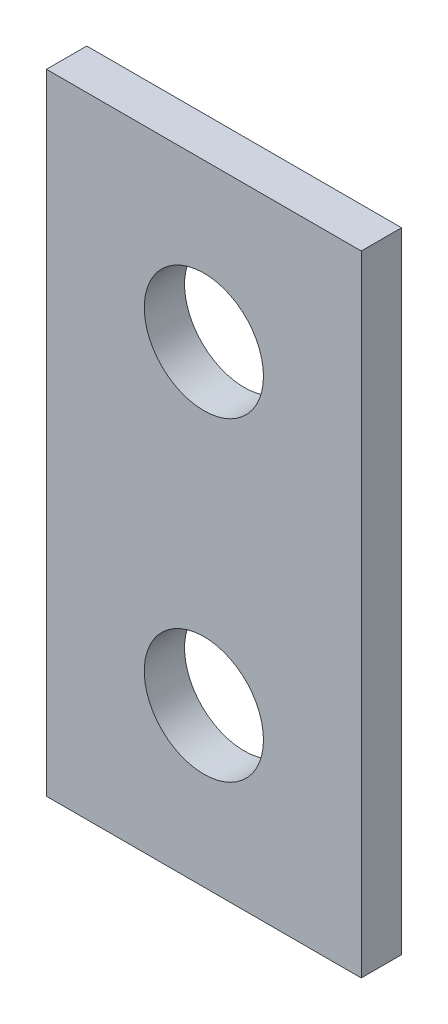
ISO-10303-21;
HEADER;
FILE_DESCRIPTION(('STEP AP214'),'2;1');
FILE_NAME('part.step','',(''),(''),'','','');
FILE_SCHEMA(('AUTOMOTIVE_DESIGN { 1 0 10303 214 1 1 1 1 }'));
ENDSEC;
DATA;
#1=APPLICATION_CONTEXT('core data for automotive mechanical design processes');
#2=APPLICATION_PROTOCOL_DEFINITION('international standard','automotive_design',2000,#1);
#3=PRODUCT_CONTEXT('',#1,'mechanical');
#4=PRODUCT('Part','Part','',(#3));
#5=PRODUCT_RELATED_PRODUCT_CATEGORY('part','',(#4));
#6=PRODUCT_DEFINITION_FORMATION('','',#4);
#7=PRODUCT_DEFINITION_CONTEXT('part definition',#1,'design');
#8=PRODUCT_DEFINITION('design','',#6,#7);
#9=PRODUCT_DEFINITION_SHAPE('','',#8);
#10=(LENGTH_UNIT() NAMED_UNIT(*) SI_UNIT(.MILLI.,.METRE.));
#11=(NAMED_UNIT(*) PLANE_ANGLE_UNIT() SI_UNIT($,.RADIAN.));
#12=(NAMED_UNIT(*) SI_UNIT($,.STERADIAN.) SOLID_ANGLE_UNIT());
#13=UNCERTAINTY_MEASURE_WITH_UNIT(LENGTH_MEASURE(1.E-05),#10,'distance_accuracy_value','');
#14=(GEOMETRIC_REPRESENTATION_CONTEXT(3) GLOBAL_UNCERTAINTY_ASSIGNED_CONTEXT((#13)) GLOBAL_UNIT_ASSIGNED_CONTEXT((#10,
#11,#12)) REPRESENTATION_CONTEXT('',''));
#15=CARTESIAN_POINT('',(0.,0.,0.));
#16=DIRECTION('',(0.,0.,1.));
#17=DIRECTION('',(1.,0.,0.));
#18=AXIS2_PLACEMENT_3D('',#15,#16,#17);
#19=CARTESIAN_POINT('',(4.7625,-9.525,-1.2192));
#20=DIRECTION('',(1.,0.,0.));
#21=DIRECTION('',(0.,0.,-1.));
#22=AXIS2_PLACEMENT_3D('',#19,#20,#21);
#23=PLANE('',#22);
#24=DIRECTION('',(0.,1.,0.));
#25=VECTOR('',#24,1.);
#26=CARTESIAN_POINT('',(4.7625,-9.525,0.));
#27=LINE('',#26,#25);
#28=CARTESIAN_POINT('',(4.7625,-9.525,0.));
#29=VERTEX_POINT('',#28);
#30=CARTESIAN_POINT('',(4.7625,9.525,0.));
#31=VERTEX_POINT('',#30);
#32=EDGE_CURVE('E100',#29,#31,#27,.T.);
#33=ORIENTED_EDGE('',*,*,#32,.F.);
#34=DIRECTION('',(0.,0.,1.));
#35=VECTOR('',#34,1.);
#36=CARTESIAN_POINT('',(4.7625,-9.525,-1.2192));
#37=LINE('',#36,#35);
#38=CARTESIAN_POINT('',(4.7625,-9.525,-1.2192));
#39=VERTEX_POINT('',#38);
#40=EDGE_CURVE('E11',#39,#29,#37,.T.);
#41=ORIENTED_EDGE('',*,*,#40,.F.);
#42=DIRECTION('',(0.,1.,0.));
#43=VECTOR('',#42,1.);
#44=CARTESIAN_POINT('',(4.7625,-9.525,-1.2192));
#45=LINE('',#44,#43);
#46=CARTESIAN_POINT('',(4.7625,9.525,-1.2192));
#47=VERTEX_POINT('',#46);
#48=EDGE_CURVE('E93',#39,#47,#45,.T.);
#49=ORIENTED_EDGE('',*,*,#48,.T.);
#50=DIRECTION('',(0.,0.,1.));
#51=VECTOR('',#50,1.);
#52=CARTESIAN_POINT('',(4.7625,9.525,-1.2192));
#53=LINE('',#52,#51);
#54=EDGE_CURVE('E38',#47,#31,#53,.T.);
#55=ORIENTED_EDGE('',*,*,#54,.T.);
#56=EDGE_LOOP('',(#33,#41,#49,#55));
#57=FACE_BOUND('',#56,.T.);
#58=ADVANCED_FACE('F35',(#57),#23,.T.);
#59=CARTESIAN_POINT('',(-4.7625,-9.525,-1.2192));
#60=DIRECTION('',(0.,-1.,0.));
#61=DIRECTION('',(0.,0.,-1.));
#62=AXIS2_PLACEMENT_3D('',#59,#60,#61);
#63=PLANE('',#62);
#64=DIRECTION('',(1.,0.,0.));
#65=VECTOR('',#64,1.);
#66=CARTESIAN_POINT('',(-4.7625,-9.525,0.));
#67=LINE('',#66,#65);
#68=CARTESIAN_POINT('',(-4.7625,-9.525,0.));
#69=VERTEX_POINT('',#68);
#70=EDGE_CURVE('E95',#69,#29,#67,.T.);
#71=ORIENTED_EDGE('',*,*,#70,.F.);
#72=DIRECTION('',(0.,0.,1.));
#73=VECTOR('',#72,1.);
#74=CARTESIAN_POINT('',(-4.7625,-9.525,-1.2192));
#75=LINE('',#74,#73);
#76=CARTESIAN_POINT('',(-4.7625,-9.525,-1.2192));
#77=VERTEX_POINT('',#76);
#78=EDGE_CURVE('E44',#77,#69,#75,.T.);
#79=ORIENTED_EDGE('',*,*,#78,.F.);
#80=DIRECTION('',(1.,0.,0.));
#81=VECTOR('',#80,1.);
#82=CARTESIAN_POINT('',(-4.7625,-9.525,-1.2192));
#83=LINE('',#82,#81);
#84=EDGE_CURVE('E90',#77,#39,#83,.T.);
#85=ORIENTED_EDGE('',*,*,#84,.T.);
#86=ORIENTED_EDGE('',*,*,#40,.T.);
#87=EDGE_LOOP('',(#71,#79,#85,#86));
#88=FACE_BOUND('',#87,.T.);
#89=ADVANCED_FACE('F111',(#88),#63,.T.);
#90=CARTESIAN_POINT('',(-4.7625,-9.525,-1.2192));
#91=DIRECTION('',(-1.,0.,0.));
#92=DIRECTION('',(0.,0.,1.));
#93=AXIS2_PLACEMENT_3D('',#90,#91,#92);
#94=PLANE('',#93);
#95=DIRECTION('',(0.,-1.,0.));
#96=VECTOR('',#95,1.);
#97=CARTESIAN_POINT('',(-4.7625,-9.525,0.));
#98=LINE('',#97,#96);
#99=CARTESIAN_POINT('',(-4.7625,9.525,0.));
#100=VERTEX_POINT('',#99);
#101=EDGE_CURVE('E85',#100,#69,#98,.T.);
#102=ORIENTED_EDGE('',*,*,#101,.F.);
#103=DIRECTION('',(0.,0.,1.));
#104=VECTOR('',#103,1.);
#105=CARTESIAN_POINT('',(-4.7625,9.525,-1.2192));
#106=LINE('',#105,#104);
#107=CARTESIAN_POINT('',(-4.7625,9.525,-1.2192));
#108=VERTEX_POINT('',#107);
#109=EDGE_CURVE('E80',#108,#100,#106,.T.);
#110=ORIENTED_EDGE('',*,*,#109,.F.);
#111=DIRECTION('',(0.,-1.,0.));
#112=VECTOR('',#111,1.);
#113=CARTESIAN_POINT('',(-4.7625,-9.525,-1.2192));
#114=LINE('',#113,#112);
#115=EDGE_CURVE('E83',#108,#77,#114,.T.);
#116=ORIENTED_EDGE('',*,*,#115,.T.);
#117=ORIENTED_EDGE('',*,*,#78,.T.);
#118=EDGE_LOOP('',(#102,#110,#116,#117));
#119=FACE_BOUND('',#118,.T.);
#120=ADVANCED_FACE('F82',(#119),#94,.T.);
#121=CARTESIAN_POINT('',(-4.7625,9.525,-1.2192));
#122=DIRECTION('',(0.,1.,0.));
#123=DIRECTION('',(0.,0.,1.));
#124=AXIS2_PLACEMENT_3D('',#121,#122,#123);
#125=PLANE('',#124);
#126=DIRECTION('',(-1.,0.,0.));
#127=VECTOR('',#126,1.);
#128=CARTESIAN_POINT('',(-4.7625,9.525,0.));
#129=LINE('',#128,#127);
#130=EDGE_CURVE('E103',#31,#100,#129,.T.);
#131=ORIENTED_EDGE('',*,*,#130,.F.);
#132=ORIENTED_EDGE('',*,*,#54,.F.);
#133=DIRECTION('',(-1.,0.,0.));
#134=VECTOR('',#133,1.);
#135=CARTESIAN_POINT('',(-4.7625,9.525,-1.2192));
#136=LINE('',#135,#134);
#137=EDGE_CURVE('E89',#47,#108,#136,.T.);
#138=ORIENTED_EDGE('',*,*,#137,.T.);
#139=ORIENTED_EDGE('',*,*,#109,.T.);
#140=EDGE_LOOP('',(#131,#132,#138,#139));
#141=FACE_BOUND('',#140,.T.);
#142=ADVANCED_FACE('F92',(#141),#125,.T.);
#143=CARTESIAN_POINT('',(0.,0.,-1.2192));
#144=DIRECTION('',(0.,0.,-1.));
#145=DIRECTION('',(-1.,0.,0.));
#146=AXIS2_PLACEMENT_3D('',#143,#144,#145);
#147=PLANE('',#146);
#148=CARTESIAN_POINT('',(0.,-4.7625,-1.2192));
#149=DIRECTION('',(0.,0.,1.));
#150=DIRECTION('',(1.,0.,0.));
#151=AXIS2_PLACEMENT_3D('',#148,#149,#150);
#152=CIRCLE('',#151,1.8034);
#153=CARTESIAN_POINT('',(1.8034,-4.7625,-1.2192));
#154=VERTEX_POINT('',#153);
#155=EDGE_CURVE('E144',#154,#154,#152,.T.);
#156=ORIENTED_EDGE('',*,*,#155,.T.);
#157=EDGE_LOOP('',(#156));
#158=FACE_BOUND('',#157,.T.);
#159=CARTESIAN_POINT('',(0.,4.7625,-1.2192));
#160=DIRECTION('',(0.,0.,1.));
#161=DIRECTION('',(1.,0.,0.));
#162=AXIS2_PLACEMENT_3D('',#159,#160,#161);
#163=CIRCLE('',#162,1.8034);
#164=CARTESIAN_POINT('',(1.8034,4.7625,-1.2192));
#165=VERTEX_POINT('',#164);
#166=EDGE_CURVE('E104',#165,#165,#163,.T.);
#167=ORIENTED_EDGE('',*,*,#166,.T.);
#168=EDGE_LOOP('',(#167));
#169=FACE_BOUND('',#168,.T.);
#170=ORIENTED_EDGE('',*,*,#48,.F.);
#171=ORIENTED_EDGE('',*,*,#84,.F.);
#172=ORIENTED_EDGE('',*,*,#115,.F.);
#173=ORIENTED_EDGE('',*,*,#137,.F.);
#174=EDGE_LOOP('',(#170,#171,#172,#173));
#175=FACE_BOUND('',#174,.T.);
#176=ADVANCED_FACE('F88',(#158,#169,#175),#147,.T.);
#177=CARTESIAN_POINT('',(0.,0.,0.));
#178=DIRECTION('',(0.,0.,-1.));
#179=DIRECTION('',(-1.,0.,0.));
#180=AXIS2_PLACEMENT_3D('',#177,#178,#179);
#181=PLANE('',#180);
#182=CARTESIAN_POINT('',(0.,-4.7625,0.));
#183=DIRECTION('',(0.,0.,1.));
#184=DIRECTION('',(1.,0.,0.));
#185=AXIS2_PLACEMENT_3D('',#182,#183,#184);
#186=CIRCLE('',#185,1.8034);
#187=CARTESIAN_POINT('',(1.8034,-4.7625,0.));
#188=VERTEX_POINT('',#187);
#189=EDGE_CURVE('E147',#188,#188,#186,.T.);
#190=ORIENTED_EDGE('',*,*,#189,.F.);
#191=EDGE_LOOP('',(#190));
#192=FACE_BOUND('',#191,.T.);
#193=CARTESIAN_POINT('',(0.,4.7625,0.));
#194=DIRECTION('',(0.,0.,1.));
#195=DIRECTION('',(1.,0.,0.));
#196=AXIS2_PLACEMENT_3D('',#193,#194,#195);
#197=CIRCLE('',#196,1.8034);
#198=CARTESIAN_POINT('',(1.8034,4.7625,0.));
#199=VERTEX_POINT('',#198);
#200=EDGE_CURVE('E149',#199,#199,#197,.T.);
#201=ORIENTED_EDGE('',*,*,#200,.F.);
#202=EDGE_LOOP('',(#201));
#203=FACE_BOUND('',#202,.T.);
#204=ORIENTED_EDGE('',*,*,#32,.T.);
#205=ORIENTED_EDGE('',*,*,#130,.T.);
#206=ORIENTED_EDGE('',*,*,#101,.T.);
#207=ORIENTED_EDGE('',*,*,#70,.T.);
#208=EDGE_LOOP('',(#204,#205,#206,#207));
#209=FACE_BOUND('',#208,.T.);
#210=ADVANCED_FACE('F110',(#192,#203,#209),#181,.F.);
#211=CARTESIAN_POINT('',(0.,4.7625,-1.2192));
#212=DIRECTION('',(0.,0.,1.));
#213=DIRECTION('',(1.,0.,0.));
#214=AXIS2_PLACEMENT_3D('',#211,#212,#213);
#215=CYLINDRICAL_SURFACE('',#214,1.8034);
#216=ORIENTED_EDGE('',*,*,#166,.F.);
#217=EDGE_LOOP('',(#216));
#218=FACE_BOUND('',#217,.T.);
#219=ORIENTED_EDGE('',*,*,#200,.T.);
#220=EDGE_LOOP('',(#219));
#221=FACE_BOUND('',#220,.T.);
#222=ADVANCED_FACE('F129',(#218,#221),#215,.F.);
#223=CARTESIAN_POINT('',(0.,-4.7625,-1.2192));
#224=DIRECTION('',(0.,0.,1.));
#225=DIRECTION('',(1.,0.,0.));
#226=AXIS2_PLACEMENT_3D('',#223,#224,#225);
#227=CYLINDRICAL_SURFACE('',#226,1.8034);
#228=ORIENTED_EDGE('',*,*,#155,.F.);
#229=EDGE_LOOP('',(#228));
#230=FACE_BOUND('',#229,.T.);
#231=ORIENTED_EDGE('',*,*,#189,.T.);
#232=EDGE_LOOP('',(#231));
#233=FACE_BOUND('',#232,.T.);
#234=ADVANCED_FACE('F136',(#230,#233),#227,.F.);
#235=CLOSED_SHELL('',(#58,#89,#120,#142,#176,#210,#222,#234));
#236=MANIFOLD_SOLID_BREP('B2',#235);
#237=ADVANCED_BREP_SHAPE_REPRESENTATION('',(#18,#236),#14);
#238=SHAPE_DEFINITION_REPRESENTATION(#9,#237);
ENDSEC;
END-ISO-10303-21;
